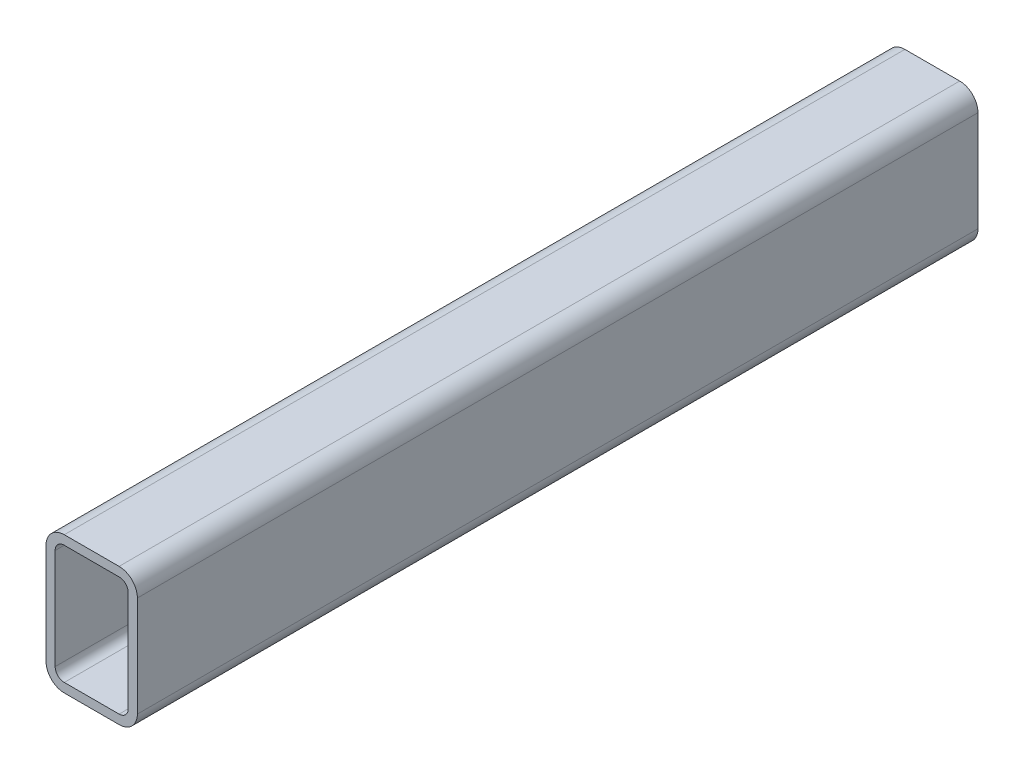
ISO-10303-21;
HEADER;
FILE_DESCRIPTION(('STEP AP214'),'2;1');
FILE_NAME('part.step','',(''),(''),'','','');
FILE_SCHEMA(('AUTOMOTIVE_DESIGN { 1 0 10303 214 1 1 1 1 }'));
ENDSEC;
DATA;
#1=APPLICATION_CONTEXT('core data for automotive mechanical design processes');
#2=APPLICATION_PROTOCOL_DEFINITION('international standard','automotive_design',2000,#1);
#3=PRODUCT_CONTEXT('',#1,'mechanical');
#4=PRODUCT('Part','Part','',(#3));
#5=PRODUCT_RELATED_PRODUCT_CATEGORY('part','',(#4));
#6=PRODUCT_DEFINITION_FORMATION('','',#4);
#7=PRODUCT_DEFINITION_CONTEXT('part definition',#1,'design');
#8=PRODUCT_DEFINITION('design','',#6,#7);
#9=PRODUCT_DEFINITION_SHAPE('','',#8);
#10=(LENGTH_UNIT() NAMED_UNIT(*) SI_UNIT(.MILLI.,.METRE.));
#11=(NAMED_UNIT(*) PLANE_ANGLE_UNIT() SI_UNIT($,.RADIAN.));
#12=(NAMED_UNIT(*) SI_UNIT($,.STERADIAN.) SOLID_ANGLE_UNIT());
#13=UNCERTAINTY_MEASURE_WITH_UNIT(LENGTH_MEASURE(1.E-05),#10,'distance_accuracy_value','');
#14=(GEOMETRIC_REPRESENTATION_CONTEXT(3) GLOBAL_UNCERTAINTY_ASSIGNED_CONTEXT((#13)) GLOBAL_UNIT_ASSIGNED_CONTEXT((#10,
#11,#12)) REPRESENTATION_CONTEXT('',''));
#15=CARTESIAN_POINT('',(0.,0.,0.));
#16=DIRECTION('',(0.,0.,1.));
#17=DIRECTION('',(1.,0.,0.));
#18=AXIS2_PLACEMENT_3D('',#15,#16,#17);
#19=CARTESIAN_POINT('',(20.,20.,460.));
#20=DIRECTION('',(0.,0.,1.));
#21=DIRECTION('',(0.999999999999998,0.,0.));
#22=AXIS2_PLACEMENT_3D('',#19,#20,#21);
#23=PLANE('',#22);
#24=CARTESIAN_POINT('',(20.,20.,460.));
#25=DIRECTION('',(0.,0.,1.));
#26=DIRECTION('',(0.999999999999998,0.,0.));
#27=AXIS2_PLACEMENT_3D('',#24,#25,#26);
#28=CIRCLE('',#27,20.);
#29=CARTESIAN_POINT('',(8.88178419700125E-13,20.,460.));
#30=VERTEX_POINT('',#29);
#31=CARTESIAN_POINT('',(20.,0.,460.));
#32=VERTEX_POINT('',#31);
#33=EDGE_CURVE('E225',#30,#32,#28,.T.);
#34=ORIENTED_EDGE('',*,*,#33,.T.);
#35=DIRECTION('',(0.999999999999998,0.,0.));
#36=VECTOR('',#35,1.);
#37=CARTESIAN_POINT('',(20.,0.,460.));
#38=LINE('',#37,#36);
#39=CARTESIAN_POINT('',(80.0000000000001,0.,460.));
#40=VERTEX_POINT('',#39);
#41=EDGE_CURVE('E228',#32,#40,#38,.T.);
#42=ORIENTED_EDGE('',*,*,#41,.T.);
#43=CARTESIAN_POINT('',(80.0000000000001,20.,460.));
#44=DIRECTION('',(0.,0.,1.));
#45=DIRECTION('',(0.999999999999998,0.,0.));
#46=AXIS2_PLACEMENT_3D('',#43,#44,#45);
#47=CIRCLE('',#46,20.);
#48=CARTESIAN_POINT('',(100.,20.,460.));
#49=VERTEX_POINT('',#48);
#50=EDGE_CURVE('E230',#40,#49,#47,.T.);
#51=ORIENTED_EDGE('',*,*,#50,.T.);
#52=DIRECTION('',(0.,1.,0.));
#53=VECTOR('',#52,1.);
#54=CARTESIAN_POINT('',(100.,20.,460.));
#55=LINE('',#54,#53);
#56=CARTESIAN_POINT('',(100.,130.,460.));
#57=VERTEX_POINT('',#56);
#58=EDGE_CURVE('E232',#49,#57,#55,.T.);
#59=ORIENTED_EDGE('',*,*,#58,.T.);
#60=CARTESIAN_POINT('',(80.0000000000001,130.,460.));
#61=DIRECTION('',(0.,0.,1.));
#62=DIRECTION('',(0.999999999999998,0.,0.));
#63=AXIS2_PLACEMENT_3D('',#60,#61,#62);
#64=CIRCLE('',#63,20.);
#65=CARTESIAN_POINT('',(80.0000000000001,150.,460.));
#66=VERTEX_POINT('',#65);
#67=EDGE_CURVE('E234',#57,#66,#64,.T.);
#68=ORIENTED_EDGE('',*,*,#67,.T.);
#69=DIRECTION('',(-0.999999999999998,0.,0.));
#70=VECTOR('',#69,1.);
#71=CARTESIAN_POINT('',(80.0000000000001,150.,460.));
#72=LINE('',#71,#70);
#73=CARTESIAN_POINT('',(20.,150.,460.));
#74=VERTEX_POINT('',#73);
#75=EDGE_CURVE('E236',#66,#74,#72,.T.);
#76=ORIENTED_EDGE('',*,*,#75,.T.);
#77=CARTESIAN_POINT('',(20.,130.,460.));
#78=DIRECTION('',(0.,0.,1.));
#79=DIRECTION('',(0.999999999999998,0.,0.));
#80=AXIS2_PLACEMENT_3D('',#77,#78,#79);
#81=CIRCLE('',#80,20.);
#82=CARTESIAN_POINT('',(8.88178419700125E-13,130.,460.));
#83=VERTEX_POINT('',#82);
#84=EDGE_CURVE('E238',#74,#83,#81,.T.);
#85=ORIENTED_EDGE('',*,*,#84,.T.);
#86=DIRECTION('',(0.,-1.,0.));
#87=VECTOR('',#86,1.);
#88=CARTESIAN_POINT('',(8.88178419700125E-13,130.,460.));
#89=LINE('',#88,#87);
#90=EDGE_CURVE('E240',#83,#30,#89,.T.);
#91=ORIENTED_EDGE('',*,*,#90,.T.);
#92=EDGE_LOOP('',(#34,#42,#51,#59,#68,#76,#85,#91));
#93=FACE_BOUND('',#92,.T.);
#94=DIRECTION('',(-0.999999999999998,0.,0.));
#95=VECTOR('',#94,1.);
#96=CARTESIAN_POINT('',(80.0000000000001,140.,460.));
#97=LINE('',#96,#95);
#98=CARTESIAN_POINT('',(80.0000000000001,140.,460.));
#99=VERTEX_POINT('',#98);
#100=CARTESIAN_POINT('',(20.,140.,460.));
#101=VERTEX_POINT('',#100);
#102=EDGE_CURVE('E183',#99,#101,#97,.T.);
#103=ORIENTED_EDGE('',*,*,#102,.F.);
#104=CARTESIAN_POINT('',(80.0000000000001,130.,460.));
#105=DIRECTION('',(0.,0.,1.));
#106=DIRECTION('',(0.999999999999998,0.,0.));
#107=AXIS2_PLACEMENT_3D('',#104,#105,#106);
#108=CIRCLE('',#107,9.99999999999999);
#109=CARTESIAN_POINT('',(89.9999999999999,130.,460.));
#110=VERTEX_POINT('',#109);
#111=EDGE_CURVE('E160',#110,#99,#108,.T.);
#112=ORIENTED_EDGE('',*,*,#111,.F.);
#113=DIRECTION('',(0.,1.,0.));
#114=VECTOR('',#113,1.);
#115=CARTESIAN_POINT('',(89.9999999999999,20.,460.));
#116=LINE('',#115,#114);
#117=CARTESIAN_POINT('',(89.9999999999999,20.,460.));
#118=VERTEX_POINT('',#117);
#119=EDGE_CURVE('E195',#118,#110,#116,.T.);
#120=ORIENTED_EDGE('',*,*,#119,.F.);
#121=CARTESIAN_POINT('',(80.0000000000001,20.,460.));
#122=DIRECTION('',(0.,0.,1.));
#123=DIRECTION('',(0.999999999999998,0.,0.));
#124=AXIS2_PLACEMENT_3D('',#121,#122,#123);
#125=CIRCLE('',#124,9.99999999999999);
#126=CARTESIAN_POINT('',(80.0000000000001,10.,460.));
#127=VERTEX_POINT('',#126);
#128=EDGE_CURVE('E193',#127,#118,#125,.T.);
#129=ORIENTED_EDGE('',*,*,#128,.F.);
#130=DIRECTION('',(0.999999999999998,0.,0.));
#131=VECTOR('',#130,1.);
#132=CARTESIAN_POINT('',(20.,10.,460.));
#133=LINE('',#132,#131);
#134=CARTESIAN_POINT('',(20.,10.,460.));
#135=VERTEX_POINT('',#134);
#136=EDGE_CURVE('E191',#135,#127,#133,.T.);
#137=ORIENTED_EDGE('',*,*,#136,.F.);
#138=CARTESIAN_POINT('',(20.,20.,460.));
#139=DIRECTION('',(0.,0.,1.));
#140=DIRECTION('',(0.999999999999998,0.,0.));
#141=AXIS2_PLACEMENT_3D('',#138,#139,#140);
#142=CIRCLE('',#141,10.);
#143=CARTESIAN_POINT('',(10.0000000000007,20.,460.));
#144=VERTEX_POINT('',#143);
#145=EDGE_CURVE('E189',#144,#135,#142,.T.);
#146=ORIENTED_EDGE('',*,*,#145,.F.);
#147=DIRECTION('',(0.,-1.,0.));
#148=VECTOR('',#147,1.);
#149=CARTESIAN_POINT('',(9.99999999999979,130.,460.));
#150=LINE('',#149,#148);
#151=CARTESIAN_POINT('',(9.99999999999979,130.,460.));
#152=VERTEX_POINT('',#151);
#153=EDGE_CURVE('E187',#152,#144,#150,.T.);
#154=ORIENTED_EDGE('',*,*,#153,.F.);
#155=CARTESIAN_POINT('',(20.,130.,460.));
#156=DIRECTION('',(0.,0.,1.));
#157=DIRECTION('',(0.999999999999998,0.,0.));
#158=AXIS2_PLACEMENT_3D('',#155,#156,#157);
#159=CIRCLE('',#158,9.99999999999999);
#160=EDGE_CURVE('E185',#101,#152,#159,.T.);
#161=ORIENTED_EDGE('',*,*,#160,.F.);
#162=EDGE_LOOP('',(#103,#112,#120,#129,#137,#146,#154,#161));
#163=FACE_BOUND('',#162,.T.);
#164=ADVANCED_FACE('F32',(#93,#163),#23,.T.);
#165=CARTESIAN_POINT('',(20.,19.9999999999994,-460.));
#166=DIRECTION('',(0.,0.,1.));
#167=DIRECTION('',(0.999999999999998,0.,0.));
#168=AXIS2_PLACEMENT_3D('',#165,#166,#167);
#169=PLANE('',#168);
#170=CARTESIAN_POINT('',(20.,19.9999999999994,-460.));
#171=DIRECTION('',(0.,0.,1.));
#172=DIRECTION('',(0.999999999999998,0.,0.));
#173=AXIS2_PLACEMENT_3D('',#170,#171,#172);
#174=CIRCLE('',#173,20.);
#175=CARTESIAN_POINT('',(0.,19.9999999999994,-460.));
#176=VERTEX_POINT('',#175);
#177=CARTESIAN_POINT('',(20.,-6.10622663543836E-13,-460.));
#178=VERTEX_POINT('',#177);
#179=EDGE_CURVE('E161',#176,#178,#174,.T.);
#180=ORIENTED_EDGE('',*,*,#179,.F.);
#181=DIRECTION('',(0.,-1.,0.));
#182=VECTOR('',#181,1.);
#183=CARTESIAN_POINT('',(0.,129.999999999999,-460.));
#184=LINE('',#183,#182);
#185=CARTESIAN_POINT('',(0.,129.999999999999,-460.));
#186=VERTEX_POINT('',#185);
#187=EDGE_CURVE('E223',#186,#176,#184,.T.);
#188=ORIENTED_EDGE('',*,*,#187,.F.);
#189=CARTESIAN_POINT('',(20.,129.999999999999,-460.));
#190=DIRECTION('',(0.,0.,1.));
#191=DIRECTION('',(0.999999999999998,0.,0.));
#192=AXIS2_PLACEMENT_3D('',#189,#190,#191);
#193=CIRCLE('',#192,20.);
#194=CARTESIAN_POINT('',(20.,149.999999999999,-460.));
#195=VERTEX_POINT('',#194);
#196=EDGE_CURVE('E221',#195,#186,#193,.T.);
#197=ORIENTED_EDGE('',*,*,#196,.F.);
#198=DIRECTION('',(-0.999999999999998,0.,0.));
#199=VECTOR('',#198,1.);
#200=CARTESIAN_POINT('',(80.0000000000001,149.999999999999,-460.));
#201=LINE('',#200,#199);
#202=CARTESIAN_POINT('',(80.0000000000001,149.999999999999,-460.));
#203=VERTEX_POINT('',#202);
#204=EDGE_CURVE('E219',#203,#195,#201,.T.);
#205=ORIENTED_EDGE('',*,*,#204,.F.);
#206=CARTESIAN_POINT('',(80.0000000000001,129.999999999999,-460.));
#207=DIRECTION('',(0.,0.,1.));
#208=DIRECTION('',(0.999999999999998,0.,0.));
#209=AXIS2_PLACEMENT_3D('',#206,#207,#208);
#210=CIRCLE('',#209,20.);
#211=CARTESIAN_POINT('',(100.,129.999999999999,-460.));
#212=VERTEX_POINT('',#211);
#213=EDGE_CURVE('E217',#212,#203,#210,.T.);
#214=ORIENTED_EDGE('',*,*,#213,.F.);
#215=DIRECTION('',(0.,1.,0.));
#216=VECTOR('',#215,1.);
#217=CARTESIAN_POINT('',(100.,19.9999999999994,-460.));
#218=LINE('',#217,#216);
#219=CARTESIAN_POINT('',(100.,19.9999999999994,-460.));
#220=VERTEX_POINT('',#219);
#221=EDGE_CURVE('E215',#220,#212,#218,.T.);
#222=ORIENTED_EDGE('',*,*,#221,.F.);
#223=CARTESIAN_POINT('',(80.0000000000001,19.9999999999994,-460.));
#224=DIRECTION('',(0.,0.,1.));
#225=DIRECTION('',(0.999999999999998,0.,0.));
#226=AXIS2_PLACEMENT_3D('',#223,#224,#225);
#227=CIRCLE('',#226,20.);
#228=CARTESIAN_POINT('',(80.0000000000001,-6.10622663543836E-13,-460.));
#229=VERTEX_POINT('',#228);
#230=EDGE_CURVE('E213',#229,#220,#227,.T.);
#231=ORIENTED_EDGE('',*,*,#230,.F.);
#232=DIRECTION('',(0.999999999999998,0.,0.));
#233=VECTOR('',#232,1.);
#234=CARTESIAN_POINT('',(20.,-6.10622663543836E-13,-460.));
#235=LINE('',#234,#233);
#236=EDGE_CURVE('E211',#178,#229,#235,.T.);
#237=ORIENTED_EDGE('',*,*,#236,.F.);
#238=EDGE_LOOP('',(#180,#188,#197,#205,#214,#222,#231,#237));
#239=FACE_BOUND('',#238,.T.);
#240=CARTESIAN_POINT('',(80.0000000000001,129.999999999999,-460.));
#241=DIRECTION('',(0.,0.,1.));
#242=DIRECTION('',(0.999999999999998,0.,0.));
#243=AXIS2_PLACEMENT_3D('',#240,#241,#242);
#244=CIRCLE('',#243,9.99999999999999);
#245=CARTESIAN_POINT('',(89.9999999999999,129.999999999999,-460.));
#246=VERTEX_POINT('',#245);
#247=CARTESIAN_POINT('',(80.0000000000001,139.999999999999,-460.));
#248=VERTEX_POINT('',#247);
#249=EDGE_CURVE('E55',#246,#248,#244,.T.);
#250=ORIENTED_EDGE('',*,*,#249,.T.);
#251=DIRECTION('',(-0.999999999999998,0.,0.));
#252=VECTOR('',#251,1.);
#253=CARTESIAN_POINT('',(80.0000000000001,139.999999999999,-460.));
#254=LINE('',#253,#252);
#255=CARTESIAN_POINT('',(20.,139.999999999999,-460.));
#256=VERTEX_POINT('',#255);
#257=EDGE_CURVE('E147',#248,#256,#254,.T.);
#258=ORIENTED_EDGE('',*,*,#257,.T.);
#259=CARTESIAN_POINT('',(20.,129.999999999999,-460.));
#260=DIRECTION('',(0.,0.,1.));
#261=DIRECTION('',(0.999999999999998,0.,0.));
#262=AXIS2_PLACEMENT_3D('',#259,#260,#261);
#263=CIRCLE('',#262,9.99999999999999);
#264=CARTESIAN_POINT('',(10.0000000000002,129.999999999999,-460.));
#265=VERTEX_POINT('',#264);
#266=EDGE_CURVE('E156',#256,#265,#263,.T.);
#267=ORIENTED_EDGE('',*,*,#266,.T.);
#268=DIRECTION('',(0.,-1.,0.));
#269=VECTOR('',#268,1.);
#270=CARTESIAN_POINT('',(10.0000000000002,129.999999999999,-460.));
#271=LINE('',#270,#269);
#272=CARTESIAN_POINT('',(10.0000000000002,19.9999999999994,-460.));
#273=VERTEX_POINT('',#272);
#274=EDGE_CURVE('E170',#265,#273,#271,.T.);
#275=ORIENTED_EDGE('',*,*,#274,.T.);
#276=CARTESIAN_POINT('',(20.,19.9999999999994,-460.));
#277=DIRECTION('',(0.,0.,1.));
#278=DIRECTION('',(0.999999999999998,0.,0.));
#279=AXIS2_PLACEMENT_3D('',#276,#277,#278);
#280=CIRCLE('',#279,10.);
#281=CARTESIAN_POINT('',(20.,9.9999999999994,-460.));
#282=VERTEX_POINT('',#281);
#283=EDGE_CURVE('E173',#273,#282,#280,.T.);
#284=ORIENTED_EDGE('',*,*,#283,.T.);
#285=DIRECTION('',(0.999999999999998,0.,0.));
#286=VECTOR('',#285,1.);
#287=CARTESIAN_POINT('',(20.,9.9999999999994,-460.));
#288=LINE('',#287,#286);
#289=CARTESIAN_POINT('',(80.0000000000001,9.9999999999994,-460.));
#290=VERTEX_POINT('',#289);
#291=EDGE_CURVE('E176',#282,#290,#288,.T.);
#292=ORIENTED_EDGE('',*,*,#291,.T.);
#293=CARTESIAN_POINT('',(80.0000000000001,19.9999999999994,-460.));
#294=DIRECTION('',(0.,0.,1.));
#295=DIRECTION('',(0.999999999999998,0.,0.));
#296=AXIS2_PLACEMENT_3D('',#293,#294,#295);
#297=CIRCLE('',#296,9.99999999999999);
#298=CARTESIAN_POINT('',(89.9999999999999,19.9999999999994,-460.));
#299=VERTEX_POINT('',#298);
#300=EDGE_CURVE('E179',#290,#299,#297,.T.);
#301=ORIENTED_EDGE('',*,*,#300,.T.);
#302=DIRECTION('',(0.,1.,0.));
#303=VECTOR('',#302,1.);
#304=CARTESIAN_POINT('',(89.9999999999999,19.9999999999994,-460.));
#305=LINE('',#304,#303);
#306=EDGE_CURVE('E166',#299,#246,#305,.T.);
#307=ORIENTED_EDGE('',*,*,#306,.T.);
#308=EDGE_LOOP('',(#250,#258,#267,#275,#284,#292,#301,#307));
#309=FACE_BOUND('',#308,.T.);
#310=ADVANCED_FACE('F164',(#239,#309),#169,.F.);
#311=CARTESIAN_POINT('',(20.,20.,460.));
#312=DIRECTION('',(0.,0.,-1.));
#313=DIRECTION('',(-0.999999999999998,0.,0.));
#314=AXIS2_PLACEMENT_3D('',#311,#312,#313);
#315=CYLINDRICAL_SURFACE('',#314,20.);
#316=ORIENTED_EDGE('',*,*,#179,.T.);
#317=DIRECTION('',(0.,0.,-1.));
#318=VECTOR('',#317,1.);
#319=CARTESIAN_POINT('',(20.,0.,460.));
#320=LINE('',#319,#318);
#321=EDGE_CURVE('E11',#32,#178,#320,.T.);
#322=ORIENTED_EDGE('',*,*,#321,.F.);
#323=ORIENTED_EDGE('',*,*,#33,.F.);
#324=DIRECTION('',(0.,0.,-1.));
#325=VECTOR('',#324,1.);
#326=CARTESIAN_POINT('',(8.88178419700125E-13,20.,460.));
#327=LINE('',#326,#325);
#328=EDGE_CURVE('E242',#30,#176,#327,.T.);
#329=ORIENTED_EDGE('',*,*,#328,.T.);
#330=EDGE_LOOP('',(#316,#322,#323,#329));
#331=FACE_BOUND('',#330,.T.);
#332=ADVANCED_FACE('F34',(#331),#315,.T.);
#333=CARTESIAN_POINT('',(20.,0.,460.));
#334=DIRECTION('',(0.,1.,0.));
#335=DIRECTION('',(0.,0.,1.));
#336=AXIS2_PLACEMENT_3D('',#333,#334,#335);
#337=PLANE('',#336);
#338=ORIENTED_EDGE('',*,*,#236,.T.);
#339=DIRECTION('',(0.,0.,-1.));
#340=VECTOR('',#339,1.);
#341=CARTESIAN_POINT('',(80.0000000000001,0.,460.));
#342=LINE('',#341,#340);
#343=EDGE_CURVE('E40',#40,#229,#342,.T.);
#344=ORIENTED_EDGE('',*,*,#343,.F.);
#345=ORIENTED_EDGE('',*,*,#41,.F.);
#346=ORIENTED_EDGE('',*,*,#321,.T.);
#347=EDGE_LOOP('',(#338,#344,#345,#346));
#348=FACE_BOUND('',#347,.T.);
#349=ADVANCED_FACE('F286',(#348),#337,.F.);
#350=CARTESIAN_POINT('',(80.0000000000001,20.,460.));
#351=DIRECTION('',(0.,0.,-1.));
#352=DIRECTION('',(-0.999999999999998,0.,0.));
#353=AXIS2_PLACEMENT_3D('',#350,#351,#352);
#354=CYLINDRICAL_SURFACE('',#353,20.);
#355=ORIENTED_EDGE('',*,*,#230,.T.);
#356=DIRECTION('',(0.,0.,-1.));
#357=VECTOR('',#356,1.);
#358=CARTESIAN_POINT('',(100.,20.,460.));
#359=LINE('',#358,#357);
#360=EDGE_CURVE('E257',#49,#220,#359,.T.);
#361=ORIENTED_EDGE('',*,*,#360,.F.);
#362=ORIENTED_EDGE('',*,*,#50,.F.);
#363=ORIENTED_EDGE('',*,*,#343,.T.);
#364=EDGE_LOOP('',(#355,#361,#362,#363));
#365=FACE_BOUND('',#364,.T.);
#366=ADVANCED_FACE('F264',(#365),#354,.T.);
#367=CARTESIAN_POINT('',(100.,20.,460.));
#368=DIRECTION('',(-0.999999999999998,0.,0.));
#369=DIRECTION('',(0.,0.,1.));
#370=AXIS2_PLACEMENT_3D('',#367,#368,#369);
#371=PLANE('',#370);
#372=ORIENTED_EDGE('',*,*,#221,.T.);
#373=DIRECTION('',(0.,0.,-1.));
#374=VECTOR('',#373,1.);
#375=CARTESIAN_POINT('',(100.,130.,460.));
#376=LINE('',#375,#374);
#377=EDGE_CURVE('E254',#57,#212,#376,.T.);
#378=ORIENTED_EDGE('',*,*,#377,.F.);
#379=ORIENTED_EDGE('',*,*,#58,.F.);
#380=ORIENTED_EDGE('',*,*,#360,.T.);
#381=EDGE_LOOP('',(#372,#378,#379,#380));
#382=FACE_BOUND('',#381,.T.);
#383=ADVANCED_FACE('F274',(#382),#371,.F.);
#384=CARTESIAN_POINT('',(80.0000000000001,130.,460.));
#385=DIRECTION('',(0.,0.,-1.));
#386=DIRECTION('',(-0.999999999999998,0.,0.));
#387=AXIS2_PLACEMENT_3D('',#384,#385,#386);
#388=CYLINDRICAL_SURFACE('',#387,20.);
#389=ORIENTED_EDGE('',*,*,#213,.T.);
#390=DIRECTION('',(0.,0.,-1.));
#391=VECTOR('',#390,1.);
#392=CARTESIAN_POINT('',(80.0000000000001,150.,460.));
#393=LINE('',#392,#391);
#394=EDGE_CURVE('E251',#66,#203,#393,.T.);
#395=ORIENTED_EDGE('',*,*,#394,.F.);
#396=ORIENTED_EDGE('',*,*,#67,.F.);
#397=ORIENTED_EDGE('',*,*,#377,.T.);
#398=EDGE_LOOP('',(#389,#395,#396,#397));
#399=FACE_BOUND('',#398,.T.);
#400=ADVANCED_FACE('F278',(#399),#388,.T.);
#401=CARTESIAN_POINT('',(80.0000000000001,150.,460.));
#402=DIRECTION('',(0.,-1.,0.));
#403=DIRECTION('',(0.,0.,-1.));
#404=AXIS2_PLACEMENT_3D('',#401,#402,#403);
#405=PLANE('',#404);
#406=ORIENTED_EDGE('',*,*,#204,.T.);
#407=DIRECTION('',(0.,0.,-1.));
#408=VECTOR('',#407,1.);
#409=CARTESIAN_POINT('',(20.,150.,460.));
#410=LINE('',#409,#408);
#411=EDGE_CURVE('E248',#74,#195,#410,.T.);
#412=ORIENTED_EDGE('',*,*,#411,.F.);
#413=ORIENTED_EDGE('',*,*,#75,.F.);
#414=ORIENTED_EDGE('',*,*,#394,.T.);
#415=EDGE_LOOP('',(#406,#412,#413,#414));
#416=FACE_BOUND('',#415,.T.);
#417=ADVANCED_FACE('F299',(#416),#405,.F.);
#418=CARTESIAN_POINT('',(20.,130.,460.));
#419=DIRECTION('',(0.,0.,-1.));
#420=DIRECTION('',(-0.999999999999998,0.,0.));
#421=AXIS2_PLACEMENT_3D('',#418,#419,#420);
#422=CYLINDRICAL_SURFACE('',#421,20.);
#423=ORIENTED_EDGE('',*,*,#196,.T.);
#424=DIRECTION('',(0.,0.,-1.));
#425=VECTOR('',#424,1.);
#426=CARTESIAN_POINT('',(8.88178419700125E-13,130.,460.));
#427=LINE('',#426,#425);
#428=EDGE_CURVE('E245',#83,#186,#427,.T.);
#429=ORIENTED_EDGE('',*,*,#428,.F.);
#430=ORIENTED_EDGE('',*,*,#84,.F.);
#431=ORIENTED_EDGE('',*,*,#411,.T.);
#432=EDGE_LOOP('',(#423,#429,#430,#431));
#433=FACE_BOUND('',#432,.T.);
#434=ADVANCED_FACE('F297',(#433),#422,.T.);
#435=CARTESIAN_POINT('',(8.88178419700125E-13,130.,460.));
#436=DIRECTION('',(0.999999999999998,0.,0.));
#437=DIRECTION('',(0.,0.,-1.));
#438=AXIS2_PLACEMENT_3D('',#435,#436,#437);
#439=PLANE('',#438);
#440=ORIENTED_EDGE('',*,*,#187,.T.);
#441=ORIENTED_EDGE('',*,*,#328,.F.);
#442=ORIENTED_EDGE('',*,*,#90,.F.);
#443=ORIENTED_EDGE('',*,*,#428,.T.);
#444=EDGE_LOOP('',(#440,#441,#442,#443));
#445=FACE_BOUND('',#444,.T.);
#446=ADVANCED_FACE('F292',(#445),#439,.F.);
#447=CARTESIAN_POINT('',(80.0000000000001,130.,460.));
#448=DIRECTION('',(0.,0.,-1.));
#449=DIRECTION('',(-0.999999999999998,0.,0.));
#450=AXIS2_PLACEMENT_3D('',#447,#448,#449);
#451=CYLINDRICAL_SURFACE('',#450,9.99999999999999);
#452=ORIENTED_EDGE('',*,*,#249,.F.);
#453=DIRECTION('',(0.,0.,-1.));
#454=VECTOR('',#453,1.);
#455=CARTESIAN_POINT('',(89.9999999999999,130.,460.));
#456=LINE('',#455,#454);
#457=EDGE_CURVE('E197',#110,#246,#456,.T.);
#458=ORIENTED_EDGE('',*,*,#457,.F.);
#459=ORIENTED_EDGE('',*,*,#111,.T.);
#460=DIRECTION('',(0.,0.,-1.));
#461=VECTOR('',#460,1.);
#462=CARTESIAN_POINT('',(80.0000000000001,140.,460.));
#463=LINE('',#462,#461);
#464=EDGE_CURVE('E149',#99,#248,#463,.T.);
#465=ORIENTED_EDGE('',*,*,#464,.T.);
#466=EDGE_LOOP('',(#452,#458,#459,#465));
#467=FACE_BOUND('',#466,.T.);
#468=ADVANCED_FACE('F158',(#467),#451,.F.);
#469=CARTESIAN_POINT('',(80.0000000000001,140.,460.));
#470=DIRECTION('',(0.,-1.,0.));
#471=DIRECTION('',(0.,0.,-1.));
#472=AXIS2_PLACEMENT_3D('',#469,#470,#471);
#473=PLANE('',#472);
#474=ORIENTED_EDGE('',*,*,#257,.F.);
#475=ORIENTED_EDGE('',*,*,#464,.F.);
#476=ORIENTED_EDGE('',*,*,#102,.T.);
#477=DIRECTION('',(0.,0.,-1.));
#478=VECTOR('',#477,1.);
#479=CARTESIAN_POINT('',(20.,140.,460.));
#480=LINE('',#479,#478);
#481=EDGE_CURVE('E152',#101,#256,#480,.T.);
#482=ORIENTED_EDGE('',*,*,#481,.T.);
#483=EDGE_LOOP('',(#474,#475,#476,#482));
#484=FACE_BOUND('',#483,.T.);
#485=ADVANCED_FACE('F148',(#484),#473,.T.);
#486=CARTESIAN_POINT('',(20.,130.,460.));
#487=DIRECTION('',(0.,0.,-1.));
#488=DIRECTION('',(-0.999999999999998,0.,0.));
#489=AXIS2_PLACEMENT_3D('',#486,#487,#488);
#490=CYLINDRICAL_SURFACE('',#489,9.99999999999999);
#491=ORIENTED_EDGE('',*,*,#266,.F.);
#492=ORIENTED_EDGE('',*,*,#481,.F.);
#493=ORIENTED_EDGE('',*,*,#160,.T.);
#494=DIRECTION('',(0.,0.,-1.));
#495=VECTOR('',#494,1.);
#496=CARTESIAN_POINT('',(9.99999999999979,130.,460.));
#497=LINE('',#496,#495);
#498=EDGE_CURVE('E206',#152,#265,#497,.T.);
#499=ORIENTED_EDGE('',*,*,#498,.T.);
#500=EDGE_LOOP('',(#491,#492,#493,#499));
#501=FACE_BOUND('',#500,.T.);
#502=ADVANCED_FACE('F323',(#501),#490,.F.);
#503=CARTESIAN_POINT('',(9.99999999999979,130.,460.));
#504=DIRECTION('',(0.999999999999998,0.,0.));
#505=DIRECTION('',(0.,1.,0.));
#506=AXIS2_PLACEMENT_3D('',#503,#504,#505);
#507=PLANE('',#506);
#508=ORIENTED_EDGE('',*,*,#274,.F.);
#509=ORIENTED_EDGE('',*,*,#498,.F.);
#510=ORIENTED_EDGE('',*,*,#153,.T.);
#511=DIRECTION('',(0.,0.,-1.));
#512=VECTOR('',#511,1.);
#513=CARTESIAN_POINT('',(10.0000000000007,20.,460.));
#514=LINE('',#513,#512);
#515=EDGE_CURVE('E204',#144,#273,#514,.T.);
#516=ORIENTED_EDGE('',*,*,#515,.T.);
#517=EDGE_LOOP('',(#508,#509,#510,#516));
#518=FACE_BOUND('',#517,.T.);
#519=ADVANCED_FACE('F328',(#518),#507,.T.);
#520=CARTESIAN_POINT('',(20.,20.,460.));
#521=DIRECTION('',(0.,0.,-1.));
#522=DIRECTION('',(-0.999999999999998,0.,0.));
#523=AXIS2_PLACEMENT_3D('',#520,#521,#522);
#524=CYLINDRICAL_SURFACE('',#523,10.);
#525=ORIENTED_EDGE('',*,*,#283,.F.);
#526=ORIENTED_EDGE('',*,*,#515,.F.);
#527=ORIENTED_EDGE('',*,*,#145,.T.);
#528=DIRECTION('',(0.,0.,-1.));
#529=VECTOR('',#528,1.);
#530=CARTESIAN_POINT('',(20.,10.,460.));
#531=LINE('',#530,#529);
#532=EDGE_CURVE('E202',#135,#282,#531,.T.);
#533=ORIENTED_EDGE('',*,*,#532,.T.);
#534=EDGE_LOOP('',(#525,#526,#527,#533));
#535=FACE_BOUND('',#534,.T.);
#536=ADVANCED_FACE('F332',(#535),#524,.F.);
#537=CARTESIAN_POINT('',(20.,10.,460.));
#538=DIRECTION('',(0.,1.,0.));
#539=DIRECTION('',(0.,0.,1.));
#540=AXIS2_PLACEMENT_3D('',#537,#538,#539);
#541=PLANE('',#540);
#542=ORIENTED_EDGE('',*,*,#291,.F.);
#543=ORIENTED_EDGE('',*,*,#532,.F.);
#544=ORIENTED_EDGE('',*,*,#136,.T.);
#545=DIRECTION('',(0.,0.,-1.));
#546=VECTOR('',#545,1.);
#547=CARTESIAN_POINT('',(80.0000000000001,10.,460.));
#548=LINE('',#547,#546);
#549=EDGE_CURVE('E200',#127,#290,#548,.T.);
#550=ORIENTED_EDGE('',*,*,#549,.T.);
#551=EDGE_LOOP('',(#542,#543,#544,#550));
#552=FACE_BOUND('',#551,.T.);
#553=ADVANCED_FACE('F336',(#552),#541,.T.);
#554=CARTESIAN_POINT('',(80.0000000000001,20.,460.));
#555=DIRECTION('',(0.,0.,-1.));
#556=DIRECTION('',(-0.999999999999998,0.,0.));
#557=AXIS2_PLACEMENT_3D('',#554,#555,#556);
#558=CYLINDRICAL_SURFACE('',#557,9.99999999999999);
#559=ORIENTED_EDGE('',*,*,#300,.F.);
#560=ORIENTED_EDGE('',*,*,#549,.F.);
#561=ORIENTED_EDGE('',*,*,#128,.T.);
#562=DIRECTION('',(0.,0.,-1.));
#563=VECTOR('',#562,1.);
#564=CARTESIAN_POINT('',(89.9999999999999,20.,460.));
#565=LINE('',#564,#563);
#566=EDGE_CURVE('E47',#118,#299,#565,.T.);
#567=ORIENTED_EDGE('',*,*,#566,.T.);
#568=EDGE_LOOP('',(#559,#560,#561,#567));
#569=FACE_BOUND('',#568,.T.);
#570=ADVANCED_FACE('F340',(#569),#558,.F.);
#571=CARTESIAN_POINT('',(89.9999999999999,20.,460.));
#572=DIRECTION('',(-0.999999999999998,0.,0.));
#573=DIRECTION('',(0.,-1.,0.));
#574=AXIS2_PLACEMENT_3D('',#571,#572,#573);
#575=PLANE('',#574);
#576=ORIENTED_EDGE('',*,*,#306,.F.);
#577=ORIENTED_EDGE('',*,*,#566,.F.);
#578=ORIENTED_EDGE('',*,*,#119,.T.);
#579=ORIENTED_EDGE('',*,*,#457,.T.);
#580=EDGE_LOOP('',(#576,#577,#578,#579));
#581=FACE_BOUND('',#580,.T.);
#582=ADVANCED_FACE('F344',(#581),#575,.T.);
#583=CLOSED_SHELL('',(#164,#310,#332,#349,#366,#383,#400,#417,#434,#446,#468,#485,#502,#519,
#536,#553,#570,#582));
#584=MANIFOLD_SOLID_BREP('B2',#583);
#585=ADVANCED_BREP_SHAPE_REPRESENTATION('',(#18,#584),#14);
#586=SHAPE_DEFINITION_REPRESENTATION(#9,#585);
ENDSEC;
END-ISO-10303-21;
